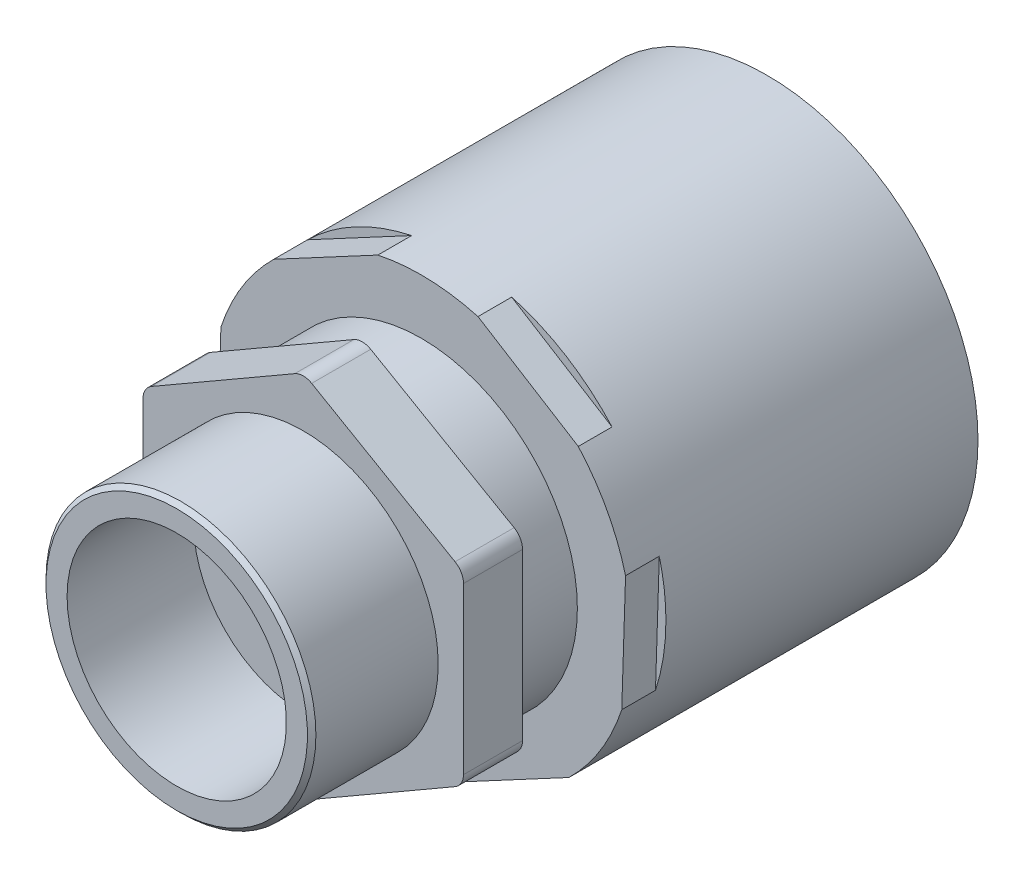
ISO-10303-21;
HEADER;
FILE_DESCRIPTION(('STEP AP214'),'2;1');
FILE_NAME('part.step','',(''),(''),'','','');
FILE_SCHEMA(('AUTOMOTIVE_DESIGN { 1 0 10303 214 1 1 1 1 }'));
ENDSEC;
DATA;
#1=APPLICATION_CONTEXT('core data for automotive mechanical design processes');
#2=APPLICATION_PROTOCOL_DEFINITION('international standard','automotive_design',2000,#1);
#3=PRODUCT_CONTEXT('',#1,'mechanical');
#4=PRODUCT('Part','Part','',(#3));
#5=PRODUCT_RELATED_PRODUCT_CATEGORY('part','',(#4));
#6=PRODUCT_DEFINITION_FORMATION('','',#4);
#7=PRODUCT_DEFINITION_CONTEXT('part definition',#1,'design');
#8=PRODUCT_DEFINITION('design','',#6,#7);
#9=PRODUCT_DEFINITION_SHAPE('','',#8);
#10=(LENGTH_UNIT() NAMED_UNIT(*) SI_UNIT(.MILLI.,.METRE.));
#11=(NAMED_UNIT(*) PLANE_ANGLE_UNIT() SI_UNIT($,.RADIAN.));
#12=(NAMED_UNIT(*) SI_UNIT($,.STERADIAN.) SOLID_ANGLE_UNIT());
#13=UNCERTAINTY_MEASURE_WITH_UNIT(LENGTH_MEASURE(1.E-05),#10,'distance_accuracy_value','');
#14=(GEOMETRIC_REPRESENTATION_CONTEXT(3) GLOBAL_UNCERTAINTY_ASSIGNED_CONTEXT((#13)) GLOBAL_UNIT_ASSIGNED_CONTEXT((#10,
#11,#12)) REPRESENTATION_CONTEXT('',''));
#15=CARTESIAN_POINT('',(0.,0.,0.));
#16=DIRECTION('',(0.,0.,1.));
#17=DIRECTION('',(1.,0.,0.));
#18=AXIS2_PLACEMENT_3D('',#15,#16,#17);
#19=CARTESIAN_POINT('',(0.,0.,15.));
#20=DIRECTION('',(0.,0.,1.));
#21=DIRECTION('',(1.,0.,0.));
#22=AXIS2_PLACEMENT_3D('',#19,#20,#21);
#23=PLANE('',#22);
#24=CARTESIAN_POINT('',(0.,0.,15.));
#25=DIRECTION('',(0.,0.,-1.));
#26=DIRECTION('',(-1.,0.,0.));
#27=AXIS2_PLACEMENT_3D('',#24,#25,#26);
#28=CIRCLE('',#27,13.);
#29=CARTESIAN_POINT('',(-13.,0.,15.));
#30=VERTEX_POINT('',#29);
#31=EDGE_CURVE('E20',#30,#30,#28,.F.);
#32=ORIENTED_EDGE('',*,*,#31,.T.);
#33=EDGE_LOOP('',(#32));
#34=FACE_BOUND('',#33,.T.);
#35=ADVANCED_FACE('F17',(#34),#23,.T.);
#36=CARTESIAN_POINT('',(0.,0.,30.));
#37=DIRECTION('',(0.,0.,-1.));
#38=DIRECTION('',(-1.,0.,0.));
#39=AXIS2_PLACEMENT_3D('',#36,#37,#38);
#40=CYLINDRICAL_SURFACE('',#39,13.);
#41=ORIENTED_EDGE('',*,*,#31,.F.);
#42=EDGE_LOOP('',(#41));
#43=FACE_BOUND('',#42,.T.);
#44=CARTESIAN_POINT('',(0.,0.,30.));
#45=DIRECTION('',(0.,0.,-1.));
#46=DIRECTION('',(-1.,0.,0.));
#47=AXIS2_PLACEMENT_3D('',#44,#45,#46);
#48=CIRCLE('',#47,13.);
#49=CARTESIAN_POINT('',(-13.,0.,30.));
#50=VERTEX_POINT('',#49);
#51=EDGE_CURVE('E409',#50,#50,#48,.T.);
#52=ORIENTED_EDGE('',*,*,#51,.F.);
#53=EDGE_LOOP('',(#52));
#54=FACE_BOUND('',#53,.T.);
#55=ADVANCED_FACE('F420',(#43,#54),#40,.F.);
#56=CARTESIAN_POINT('',(-15.5,-15.81,30.));
#57=DIRECTION('',(0.,0.,1.));
#58=DIRECTION('',(1.,0.,0.));
#59=AXIS2_PLACEMENT_3D('',#56,#57,#58);
#60=PLANE('',#59);
#61=ORIENTED_EDGE('',*,*,#51,.T.);
#62=EDGE_LOOP('',(#61));
#63=FACE_BOUND('',#62,.T.);
#64=CARTESIAN_POINT('',(0.,0.,30.));
#65=DIRECTION('',(0.,0.,-1.));
#66=DIRECTION('',(0.,1.,0.));
#67=AXIS2_PLACEMENT_3D('',#64,#65,#66);
#68=CIRCLE('',#67,15.5);
#69=CARTESIAN_POINT('',(0.,15.5,30.));
#70=VERTEX_POINT('',#69);
#71=EDGE_CURVE('E265',#70,#70,#68,.T.);
#72=ORIENTED_EDGE('',*,*,#71,.F.);
#73=EDGE_LOOP('',(#72));
#74=FACE_BOUND('',#73,.T.);
#75=ADVANCED_FACE('F423',(#63,#74),#60,.T.);
#76=CARTESIAN_POINT('',(0.,0.,29.500000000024));
#77=DIRECTION('',(0.,0.,-1.));
#78=DIRECTION('',(0.,1.,0.));
#79=AXIS2_PLACEMENT_3D('',#76,#77,#78);
#80=CONICAL_SURFACE('',#79,15.999999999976,0.785398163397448);
#81=CARTESIAN_POINT('',(0.,0.,29.500000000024));
#82=DIRECTION('',(0.,0.,1.));
#83=DIRECTION('',(1.,0.,0.));
#84=AXIS2_PLACEMENT_3D('',#81,#82,#83);
#85=CIRCLE('',#84,16.);
#86=CARTESIAN_POINT('',(16.,0.,29.500000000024));
#87=VERTEX_POINT('',#86);
#88=EDGE_CURVE('E261',#87,#87,#85,.F.);
#89=ORIENTED_EDGE('',*,*,#88,.F.);
#90=EDGE_LOOP('',(#89));
#91=FACE_BOUND('',#90,.T.);
#92=ORIENTED_EDGE('',*,*,#71,.T.);
#93=EDGE_LOOP('',(#92));
#94=FACE_BOUND('',#93,.T.);
#95=ADVANCED_FACE('F429',(#91,#94),#80,.T.);
#96=CARTESIAN_POINT('',(0.,0.,15.));
#97=DIRECTION('',(0.,0.,1.));
#98=DIRECTION('',(1.,0.,0.));
#99=AXIS2_PLACEMENT_3D('',#96,#97,#98);
#100=CYLINDRICAL_SURFACE('',#99,16.);
#101=ORIENTED_EDGE('',*,*,#88,.T.);
#102=EDGE_LOOP('',(#101));
#103=FACE_BOUND('',#102,.T.);
#104=CARTESIAN_POINT('',(0.,0.,15.));
#105=DIRECTION('',(0.,0.,1.));
#106=DIRECTION('',(1.,0.,0.));
#107=AXIS2_PLACEMENT_3D('',#104,#105,#106);
#108=CIRCLE('',#107,16.);
#109=CARTESIAN_POINT('',(16.,0.,15.));
#110=VERTEX_POINT('',#109);
#111=EDGE_CURVE('E264',#110,#110,#108,.T.);
#112=ORIENTED_EDGE('',*,*,#111,.T.);
#113=EDGE_LOOP('',(#112));
#114=FACE_BOUND('',#113,.T.);
#115=ADVANCED_FACE('F564',(#103,#114),#100,.T.);
#116=CARTESIAN_POINT('',(0.,0.,8.));
#117=DIRECTION('',(0.,0.,1.));
#118=DIRECTION('',(1.,0.,0.));
#119=AXIS2_PLACEMENT_3D('',#116,#117,#118);
#120=PLANE('',#119);
#121=CARTESIAN_POINT('',(0.,0.,8.));
#122=DIRECTION('',(0.,0.,-1.));
#123=DIRECTION('',(-1.,0.,0.));
#124=AXIS2_PLACEMENT_3D('',#121,#122,#123);
#125=CIRCLE('',#124,17.5);
#126=CARTESIAN_POINT('',(-17.5,0.,8.));
#127=VERTEX_POINT('',#126);
#128=EDGE_CURVE('E236',#127,#127,#125,.T.);
#129=ORIENTED_EDGE('',*,*,#128,.T.);
#130=EDGE_LOOP('',(#129));
#131=FACE_BOUND('',#130,.T.);
#132=ADVANCED_FACE('F561',(#131),#120,.F.);
#133=CARTESIAN_POINT('',(-23.000000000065,23.4600000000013,15.));
#134=DIRECTION('',(0.,0.,-1.));
#135=DIRECTION('',(-1.,0.,0.));
#136=AXIS2_PLACEMENT_3D('',#133,#134,#135);
#137=PLANE('',#136);
#138=CARTESIAN_POINT('',(17.,-9.81495457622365,15.));
#139=DIRECTION('',(0.,0.,1.));
#140=DIRECTION('',(1.,0.,0.));
#141=AXIS2_PLACEMENT_3D('',#138,#139,#140);
#142=CIRCLE('',#141,2.);
#143=CARTESIAN_POINT('',(19.,-9.81495457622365,15.));
#144=VERTEX_POINT('',#143);
#145=CARTESIAN_POINT('',(18.,-11.5470053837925,15.));
#146=VERTEX_POINT('',#145);
#147=EDGE_CURVE('E375',#144,#146,#142,.F.);
#148=ORIENTED_EDGE('',*,*,#147,.F.);
#149=DIRECTION('',(0.,1.,0.));
#150=VECTOR('',#149,1.);
#151=CARTESIAN_POINT('',(19.,-10.9696551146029,15.));
#152=LINE('',#151,#150);
#153=CARTESIAN_POINT('',(19.,9.81495457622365,15.));
#154=VERTEX_POINT('',#153);
#155=EDGE_CURVE('E232',#154,#144,#152,.F.);
#156=ORIENTED_EDGE('',*,*,#155,.F.);
#157=CARTESIAN_POINT('',(17.,9.81495457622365,15.));
#158=DIRECTION('',(0.,0.,1.));
#159=DIRECTION('',(1.,0.,0.));
#160=AXIS2_PLACEMENT_3D('',#157,#158,#159);
#161=CIRCLE('',#160,2.);
#162=CARTESIAN_POINT('',(18.,11.5470053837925,15.));
#163=VERTEX_POINT('',#162);
#164=EDGE_CURVE('E224',#163,#154,#161,.F.);
#165=ORIENTED_EDGE('',*,*,#164,.F.);
#166=DIRECTION('',(-0.866025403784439,0.5,0.));
#167=VECTOR('',#166,1.);
#168=CARTESIAN_POINT('',(19.,10.9696551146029,15.));
#169=LINE('',#168,#167);
#170=CARTESIAN_POINT('',(1.00000000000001,21.3619599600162,15.));
#171=VERTEX_POINT('',#170);
#172=EDGE_CURVE('E229',#171,#163,#169,.F.);
#173=ORIENTED_EDGE('',*,*,#172,.F.);
#174=CARTESIAN_POINT('',(0.,19.6299091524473,15.));
#175=DIRECTION('',(0.,0.,1.));
#176=DIRECTION('',(1.,0.,0.));
#177=AXIS2_PLACEMENT_3D('',#174,#175,#176);
#178=CIRCLE('',#177,2.);
#179=CARTESIAN_POINT('',(-0.99999999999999,21.3619599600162,15.));
#180=VERTEX_POINT('',#179);
#181=EDGE_CURVE('E246',#180,#171,#178,.F.);
#182=ORIENTED_EDGE('',*,*,#181,.F.);
#183=DIRECTION('',(-0.866025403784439,-0.5,0.));
#184=VECTOR('',#183,1.);
#185=CARTESIAN_POINT('',(0.,21.9393102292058,15.));
#186=LINE('',#185,#184);
#187=CARTESIAN_POINT('',(-18.,11.5470053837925,15.));
#188=VERTEX_POINT('',#187);
#189=EDGE_CURVE('E259',#188,#180,#186,.F.);
#190=ORIENTED_EDGE('',*,*,#189,.F.);
#191=CARTESIAN_POINT('',(-17.,9.81495457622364,15.));
#192=DIRECTION('',(0.,0.,1.));
#193=DIRECTION('',(1.,0.,0.));
#194=AXIS2_PLACEMENT_3D('',#191,#192,#193);
#195=CIRCLE('',#194,2.);
#196=CARTESIAN_POINT('',(-19.,9.81495457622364,15.));
#197=VERTEX_POINT('',#196);
#198=EDGE_CURVE('E393',#197,#188,#195,.F.);
#199=ORIENTED_EDGE('',*,*,#198,.F.);
#200=DIRECTION('',(0.,1.,0.));
#201=VECTOR('',#200,1.);
#202=CARTESIAN_POINT('',(-19.,10.9696551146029,15.));
#203=LINE('',#202,#201);
#204=CARTESIAN_POINT('',(-19.,-9.81495457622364,15.));
#205=VERTEX_POINT('',#204);
#206=EDGE_CURVE('E969',#205,#197,#203,.T.);
#207=ORIENTED_EDGE('',*,*,#206,.F.);
#208=CARTESIAN_POINT('',(-17.,-9.81495457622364,15.));
#209=DIRECTION('',(0.,0.,1.));
#210=DIRECTION('',(1.,0.,0.));
#211=AXIS2_PLACEMENT_3D('',#208,#209,#210);
#212=CIRCLE('',#211,2.);
#213=CARTESIAN_POINT('',(-18.,-11.5470053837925,15.));
#214=VERTEX_POINT('',#213);
#215=EDGE_CURVE('E387',#214,#205,#212,.F.);
#216=ORIENTED_EDGE('',*,*,#215,.F.);
#217=DIRECTION('',(0.866025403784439,-0.5,0.));
#218=VECTOR('',#217,1.);
#219=CARTESIAN_POINT('',(-19.,-10.9696551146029,15.));
#220=LINE('',#219,#218);
#221=CARTESIAN_POINT('',(-1.00000000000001,-21.3619599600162,15.));
#222=VERTEX_POINT('',#221);
#223=EDGE_CURVE('E982',#222,#214,#220,.F.);
#224=ORIENTED_EDGE('',*,*,#223,.F.);
#225=CARTESIAN_POINT('',(0.,-19.6299091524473,15.));
#226=DIRECTION('',(0.,0.,1.));
#227=DIRECTION('',(1.,0.,0.));
#228=AXIS2_PLACEMENT_3D('',#225,#226,#227);
#229=CIRCLE('',#228,2.);
#230=CARTESIAN_POINT('',(0.999999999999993,-21.3619599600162,15.));
#231=VERTEX_POINT('',#230);
#232=EDGE_CURVE('E381',#231,#222,#229,.F.);
#233=ORIENTED_EDGE('',*,*,#232,.F.);
#234=DIRECTION('',(0.866025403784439,0.5,0.));
#235=VECTOR('',#234,1.);
#236=CARTESIAN_POINT('',(0.,-21.9393102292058,15.));
#237=LINE('',#236,#235);
#238=EDGE_CURVE('E986',#146,#231,#237,.F.);
#239=ORIENTED_EDGE('',*,*,#238,.F.);
#240=EDGE_LOOP('',(#148,#156,#165,#173,#182,#190,#199,#207,#216,#224,#233,#239));
#241=FACE_BOUND('',#240,.T.);
#242=ORIENTED_EDGE('',*,*,#111,.F.);
#243=EDGE_LOOP('',(#242));
#244=FACE_BOUND('',#243,.T.);
#245=ADVANCED_FACE('F226',(#241,#244),#137,.F.);
#246=CARTESIAN_POINT('',(0.,0.,13.));
#247=DIRECTION('',(0.,0.,-1.));
#248=DIRECTION('',(-1.,0.,0.));
#249=AXIS2_PLACEMENT_3D('',#246,#247,#248);
#250=CYLINDRICAL_SURFACE('',#249,17.5);
#251=ORIENTED_EDGE('',*,*,#128,.F.);
#252=EDGE_LOOP('',(#251));
#253=FACE_BOUND('',#252,.T.);
#254=CARTESIAN_POINT('',(0.,0.,-3.000000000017));
#255=DIRECTION('',(0.,0.,-1.));
#256=DIRECTION('',(-1.,0.,0.));
#257=AXIS2_PLACEMENT_3D('',#254,#255,#256);
#258=CIRCLE('',#257,17.5);
#259=CARTESIAN_POINT('',(-17.5,0.,-3.000000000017));
#260=VERTEX_POINT('',#259);
#261=EDGE_CURVE('E370',#260,#260,#258,.F.);
#262=ORIENTED_EDGE('',*,*,#261,.F.);
#263=EDGE_LOOP('',(#262));
#264=FACE_BOUND('',#263,.T.);
#265=ADVANCED_FACE('F555',(#253,#264),#250,.F.);
#266=CARTESIAN_POINT('',(17.,9.81495457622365,8.));
#267=DIRECTION('',(0.,0.,1.));
#268=DIRECTION('',(1.,0.,0.));
#269=AXIS2_PLACEMENT_3D('',#266,#267,#268);
#270=CYLINDRICAL_SURFACE('',#269,2.);
#271=ORIENTED_EDGE('',*,*,#164,.T.);
#272=DIRECTION('',(0.,0.,1.));
#273=VECTOR('',#272,1.);
#274=CARTESIAN_POINT('',(19.,9.81495457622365,8.));
#275=LINE('',#274,#273);
#276=CARTESIAN_POINT('',(19.,9.81495457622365,8.));
#277=VERTEX_POINT('',#276);
#278=EDGE_CURVE('E374',#277,#154,#275,.T.);
#279=ORIENTED_EDGE('',*,*,#278,.F.);
#280=CARTESIAN_POINT('',(17.,9.81495457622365,8.));
#281=DIRECTION('',(0.,0.,1.));
#282=DIRECTION('',(1.,0.,0.));
#283=AXIS2_PLACEMENT_3D('',#280,#281,#282);
#284=CIRCLE('',#283,2.);
#285=CARTESIAN_POINT('',(18.,11.5470053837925,8.));
#286=VERTEX_POINT('',#285);
#287=EDGE_CURVE('E242',#277,#286,#284,.T.);
#288=ORIENTED_EDGE('',*,*,#287,.T.);
#289=DIRECTION('',(0.,0.,1.));
#290=VECTOR('',#289,1.);
#291=CARTESIAN_POINT('',(18.,11.5470053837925,8.));
#292=LINE('',#291,#290);
#293=EDGE_CURVE('E239',#163,#286,#292,.F.);
#294=ORIENTED_EDGE('',*,*,#293,.F.);
#295=EDGE_LOOP('',(#271,#279,#288,#294));
#296=FACE_BOUND('',#295,.T.);
#297=ADVANCED_FACE('F240',(#296),#270,.T.);
#298=CARTESIAN_POINT('',(19.,10.9696551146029,8.));
#299=DIRECTION('',(0.5,0.866025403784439,0.));
#300=DIRECTION('',(-0.866025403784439,0.5,0.));
#301=AXIS2_PLACEMENT_3D('',#298,#299,#300);
#302=PLANE('',#301);
#303=ORIENTED_EDGE('',*,*,#172,.T.);
#304=ORIENTED_EDGE('',*,*,#293,.T.);
#305=DIRECTION('',(-0.866025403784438,0.5,0.));
#306=VECTOR('',#305,1.);
#307=CARTESIAN_POINT('',(18.,11.5470053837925,8.));
#308=LINE('',#307,#306);
#309=CARTESIAN_POINT('',(1.00000000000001,21.3619599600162,8.));
#310=VERTEX_POINT('',#309);
#311=EDGE_CURVE('E367',#286,#310,#308,.T.);
#312=ORIENTED_EDGE('',*,*,#311,.T.);
#313=DIRECTION('',(0.,0.,1.));
#314=VECTOR('',#313,1.);
#315=CARTESIAN_POINT('',(1.00000000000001,21.3619599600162,8.));
#316=LINE('',#315,#314);
#317=EDGE_CURVE('E250',#171,#310,#316,.F.);
#318=ORIENTED_EDGE('',*,*,#317,.F.);
#319=EDGE_LOOP('',(#303,#304,#312,#318));
#320=FACE_BOUND('',#319,.T.);
#321=ADVANCED_FACE('F248',(#320),#302,.T.);
#322=CARTESIAN_POINT('',(0.,19.6299091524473,8.));
#323=DIRECTION('',(0.,0.,1.));
#324=DIRECTION('',(1.,0.,0.));
#325=AXIS2_PLACEMENT_3D('',#322,#323,#324);
#326=CYLINDRICAL_SURFACE('',#325,2.);
#327=ORIENTED_EDGE('',*,*,#181,.T.);
#328=ORIENTED_EDGE('',*,*,#317,.T.);
#329=CARTESIAN_POINT('',(0.,19.6299091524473,8.));
#330=DIRECTION('',(0.,0.,1.));
#331=DIRECTION('',(1.,0.,0.));
#332=AXIS2_PLACEMENT_3D('',#329,#330,#331);
#333=CIRCLE('',#332,2.);
#334=CARTESIAN_POINT('',(-0.99999999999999,21.3619599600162,8.));
#335=VERTEX_POINT('',#334);
#336=EDGE_CURVE('E364',#310,#335,#333,.T.);
#337=ORIENTED_EDGE('',*,*,#336,.T.);
#338=DIRECTION('',(0.,0.,1.));
#339=VECTOR('',#338,1.);
#340=CARTESIAN_POINT('',(-0.99999999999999,21.3619599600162,8.));
#341=LINE('',#340,#339);
#342=EDGE_CURVE('E398',#180,#335,#341,.F.);
#343=ORIENTED_EDGE('',*,*,#342,.F.);
#344=EDGE_LOOP('',(#327,#328,#337,#343));
#345=FACE_BOUND('',#344,.T.);
#346=ADVANCED_FACE('F546',(#345),#326,.T.);
#347=CARTESIAN_POINT('',(0.,21.9393102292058,8.));
#348=DIRECTION('',(-0.5,0.866025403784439,0.));
#349=DIRECTION('',(-0.866025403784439,-0.5,0.));
#350=AXIS2_PLACEMENT_3D('',#347,#348,#349);
#351=PLANE('',#350);
#352=ORIENTED_EDGE('',*,*,#189,.T.);
#353=ORIENTED_EDGE('',*,*,#342,.T.);
#354=DIRECTION('',(-0.866025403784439,-0.5,0.));
#355=VECTOR('',#354,1.);
#356=CARTESIAN_POINT('',(-0.999999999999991,21.3619599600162,8.));
#357=LINE('',#356,#355);
#358=CARTESIAN_POINT('',(-18.,11.5470053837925,8.));
#359=VERTEX_POINT('',#358);
#360=EDGE_CURVE('E363',#335,#359,#357,.T.);
#361=ORIENTED_EDGE('',*,*,#360,.T.);
#362=DIRECTION('',(0.,0.,1.));
#363=VECTOR('',#362,1.);
#364=CARTESIAN_POINT('',(-18.,11.5470053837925,8.));
#365=LINE('',#364,#363);
#366=EDGE_CURVE('E397',#188,#359,#365,.F.);
#367=ORIENTED_EDGE('',*,*,#366,.F.);
#368=EDGE_LOOP('',(#352,#353,#361,#367));
#369=FACE_BOUND('',#368,.T.);
#370=ADVANCED_FACE('F542',(#369),#351,.T.);
#371=CARTESIAN_POINT('',(-17.,9.81495457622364,8.));
#372=DIRECTION('',(0.,0.,1.));
#373=DIRECTION('',(1.,0.,0.));
#374=AXIS2_PLACEMENT_3D('',#371,#372,#373);
#375=CYLINDRICAL_SURFACE('',#374,2.);
#376=ORIENTED_EDGE('',*,*,#198,.T.);
#377=ORIENTED_EDGE('',*,*,#366,.T.);
#378=CARTESIAN_POINT('',(-17.,9.81495457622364,8.));
#379=DIRECTION('',(0.,0.,1.));
#380=DIRECTION('',(1.,0.,0.));
#381=AXIS2_PLACEMENT_3D('',#378,#379,#380);
#382=CIRCLE('',#381,2.);
#383=CARTESIAN_POINT('',(-19.,9.81495457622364,8.));
#384=VERTEX_POINT('',#383);
#385=EDGE_CURVE('E360',#359,#384,#382,.T.);
#386=ORIENTED_EDGE('',*,*,#385,.T.);
#387=DIRECTION('',(0.,0.,1.));
#388=VECTOR('',#387,1.);
#389=CARTESIAN_POINT('',(-19.,9.81495457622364,8.));
#390=LINE('',#389,#388);
#391=EDGE_CURVE('E392',#197,#384,#390,.F.);
#392=ORIENTED_EDGE('',*,*,#391,.F.);
#393=EDGE_LOOP('',(#376,#377,#386,#392));
#394=FACE_BOUND('',#393,.T.);
#395=ADVANCED_FACE('F538',(#394),#375,.T.);
#396=CARTESIAN_POINT('',(-19.,10.9696551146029,8.));
#397=DIRECTION('',(-1.,0.,0.));
#398=DIRECTION('',(0.,0.,1.));
#399=AXIS2_PLACEMENT_3D('',#396,#397,#398);
#400=PLANE('',#399);
#401=ORIENTED_EDGE('',*,*,#206,.T.);
#402=ORIENTED_EDGE('',*,*,#391,.T.);
#403=DIRECTION('',(0.,1.,0.));
#404=VECTOR('',#403,1.);
#405=CARTESIAN_POINT('',(-19.,0.,8.));
#406=LINE('',#405,#404);
#407=CARTESIAN_POINT('',(-19.,-9.81495457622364,8.));
#408=VERTEX_POINT('',#407);
#409=EDGE_CURVE('E359',#384,#408,#406,.F.);
#410=ORIENTED_EDGE('',*,*,#409,.T.);
#411=DIRECTION('',(0.,0.,1.));
#412=VECTOR('',#411,1.);
#413=CARTESIAN_POINT('',(-19.,-9.81495457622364,8.));
#414=LINE('',#413,#412);
#415=EDGE_CURVE('E391',#205,#408,#414,.F.);
#416=ORIENTED_EDGE('',*,*,#415,.F.);
#417=EDGE_LOOP('',(#401,#402,#410,#416));
#418=FACE_BOUND('',#417,.T.);
#419=ADVANCED_FACE('F534',(#418),#400,.T.);
#420=CARTESIAN_POINT('',(-17.,-9.81495457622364,8.));
#421=DIRECTION('',(0.,0.,1.));
#422=DIRECTION('',(1.,0.,0.));
#423=AXIS2_PLACEMENT_3D('',#420,#421,#422);
#424=CYLINDRICAL_SURFACE('',#423,2.);
#425=ORIENTED_EDGE('',*,*,#215,.T.);
#426=ORIENTED_EDGE('',*,*,#415,.T.);
#427=CARTESIAN_POINT('',(-17.,-9.81495457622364,8.));
#428=DIRECTION('',(0.,0.,1.));
#429=DIRECTION('',(1.,0.,0.));
#430=AXIS2_PLACEMENT_3D('',#427,#428,#429);
#431=CIRCLE('',#430,2.);
#432=CARTESIAN_POINT('',(-18.,-11.5470053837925,8.));
#433=VERTEX_POINT('',#432);
#434=EDGE_CURVE('E356',#408,#433,#431,.T.);
#435=ORIENTED_EDGE('',*,*,#434,.T.);
#436=DIRECTION('',(0.,0.,1.));
#437=VECTOR('',#436,1.);
#438=CARTESIAN_POINT('',(-18.,-11.5470053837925,8.));
#439=LINE('',#438,#437);
#440=EDGE_CURVE('E386',#214,#433,#439,.F.);
#441=ORIENTED_EDGE('',*,*,#440,.F.);
#442=EDGE_LOOP('',(#425,#426,#435,#441));
#443=FACE_BOUND('',#442,.T.);
#444=ADVANCED_FACE('F530',(#443),#424,.T.);
#445=CARTESIAN_POINT('',(-19.,-10.9696551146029,8.));
#446=DIRECTION('',(-0.5,-0.866025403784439,0.));
#447=DIRECTION('',(0.866025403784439,-0.5,0.));
#448=AXIS2_PLACEMENT_3D('',#445,#446,#447);
#449=PLANE('',#448);
#450=ORIENTED_EDGE('',*,*,#223,.T.);
#451=ORIENTED_EDGE('',*,*,#440,.T.);
#452=DIRECTION('',(0.866025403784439,-0.5,0.));
#453=VECTOR('',#452,1.);
#454=CARTESIAN_POINT('',(-18.,-11.5470053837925,8.));
#455=LINE('',#454,#453);
#456=CARTESIAN_POINT('',(-1.00000000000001,-21.3619599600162,8.));
#457=VERTEX_POINT('',#456);
#458=EDGE_CURVE('E355',#433,#457,#455,.T.);
#459=ORIENTED_EDGE('',*,*,#458,.T.);
#460=DIRECTION('',(0.,0.,1.));
#461=VECTOR('',#460,1.);
#462=CARTESIAN_POINT('',(-1.00000000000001,-21.3619599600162,8.));
#463=LINE('',#462,#461);
#464=EDGE_CURVE('E385',#222,#457,#463,.F.);
#465=ORIENTED_EDGE('',*,*,#464,.F.);
#466=EDGE_LOOP('',(#450,#451,#459,#465));
#467=FACE_BOUND('',#466,.T.);
#468=ADVANCED_FACE('F526',(#467),#449,.T.);
#469=CARTESIAN_POINT('',(0.,-19.6299091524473,8.));
#470=DIRECTION('',(0.,0.,1.));
#471=DIRECTION('',(1.,0.,0.));
#472=AXIS2_PLACEMENT_3D('',#469,#470,#471);
#473=CYLINDRICAL_SURFACE('',#472,2.);
#474=ORIENTED_EDGE('',*,*,#232,.T.);
#475=ORIENTED_EDGE('',*,*,#464,.T.);
#476=CARTESIAN_POINT('',(0.,-19.6299091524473,8.));
#477=DIRECTION('',(0.,0.,1.));
#478=DIRECTION('',(1.,0.,0.));
#479=AXIS2_PLACEMENT_3D('',#476,#477,#478);
#480=CIRCLE('',#479,2.);
#481=CARTESIAN_POINT('',(0.999999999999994,-21.3619599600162,8.));
#482=VERTEX_POINT('',#481);
#483=EDGE_CURVE('E352',#457,#482,#480,.T.);
#484=ORIENTED_EDGE('',*,*,#483,.T.);
#485=DIRECTION('',(0.,0.,1.));
#486=VECTOR('',#485,1.);
#487=CARTESIAN_POINT('',(0.999999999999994,-21.3619599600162,8.));
#488=LINE('',#487,#486);
#489=EDGE_CURVE('E380',#231,#482,#488,.F.);
#490=ORIENTED_EDGE('',*,*,#489,.F.);
#491=EDGE_LOOP('',(#474,#475,#484,#490));
#492=FACE_BOUND('',#491,.T.);
#493=ADVANCED_FACE('F522',(#492),#473,.T.);
#494=CARTESIAN_POINT('',(0.,-21.9393102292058,8.));
#495=DIRECTION('',(0.5,-0.866025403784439,0.));
#496=DIRECTION('',(0.866025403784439,0.5,0.));
#497=AXIS2_PLACEMENT_3D('',#494,#495,#496);
#498=PLANE('',#497);
#499=ORIENTED_EDGE('',*,*,#238,.T.);
#500=ORIENTED_EDGE('',*,*,#489,.T.);
#501=DIRECTION('',(0.866025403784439,0.5,0.));
#502=VECTOR('',#501,1.);
#503=CARTESIAN_POINT('',(0.999999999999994,-21.3619599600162,8.));
#504=LINE('',#503,#502);
#505=CARTESIAN_POINT('',(18.,-11.5470053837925,8.));
#506=VERTEX_POINT('',#505);
#507=EDGE_CURVE('E351',#482,#506,#504,.T.);
#508=ORIENTED_EDGE('',*,*,#507,.T.);
#509=DIRECTION('',(0.,0.,1.));
#510=VECTOR('',#509,1.);
#511=CARTESIAN_POINT('',(18.,-11.5470053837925,8.));
#512=LINE('',#511,#510);
#513=EDGE_CURVE('E379',#146,#506,#512,.F.);
#514=ORIENTED_EDGE('',*,*,#513,.F.);
#515=EDGE_LOOP('',(#499,#500,#508,#514));
#516=FACE_BOUND('',#515,.T.);
#517=ADVANCED_FACE('F518',(#516),#498,.T.);
#518=CARTESIAN_POINT('',(17.,-9.81495457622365,8.));
#519=DIRECTION('',(0.,0.,1.));
#520=DIRECTION('',(1.,0.,0.));
#521=AXIS2_PLACEMENT_3D('',#518,#519,#520);
#522=CYLINDRICAL_SURFACE('',#521,2.);
#523=ORIENTED_EDGE('',*,*,#147,.T.);
#524=ORIENTED_EDGE('',*,*,#513,.T.);
#525=CARTESIAN_POINT('',(17.,-9.81495457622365,8.));
#526=DIRECTION('',(0.,0.,1.));
#527=DIRECTION('',(1.,0.,0.));
#528=AXIS2_PLACEMENT_3D('',#525,#526,#527);
#529=CIRCLE('',#528,2.);
#530=CARTESIAN_POINT('',(19.,-9.81495457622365,8.));
#531=VERTEX_POINT('',#530);
#532=EDGE_CURVE('E348',#506,#531,#529,.T.);
#533=ORIENTED_EDGE('',*,*,#532,.T.);
#534=DIRECTION('',(0.,0.,1.));
#535=VECTOR('',#534,1.);
#536=CARTESIAN_POINT('',(19.,-9.81495457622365,8.));
#537=LINE('',#536,#535);
#538=EDGE_CURVE('E991',#144,#531,#537,.F.);
#539=ORIENTED_EDGE('',*,*,#538,.F.);
#540=EDGE_LOOP('',(#523,#524,#533,#539));
#541=FACE_BOUND('',#540,.T.);
#542=ADVANCED_FACE('F514',(#541),#522,.T.);
#543=CARTESIAN_POINT('',(19.,-10.9696551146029,8.));
#544=DIRECTION('',(1.,0.,0.));
#545=DIRECTION('',(0.,1.,0.));
#546=AXIS2_PLACEMENT_3D('',#543,#544,#545);
#547=PLANE('',#546);
#548=DIRECTION('',(0.,1.,0.));
#549=VECTOR('',#548,1.);
#550=CARTESIAN_POINT('',(19.,0.,8.));
#551=LINE('',#550,#549);
#552=EDGE_CURVE('E347',#531,#277,#551,.T.);
#553=ORIENTED_EDGE('',*,*,#552,.T.);
#554=ORIENTED_EDGE('',*,*,#278,.T.);
#555=ORIENTED_EDGE('',*,*,#155,.T.);
#556=ORIENTED_EDGE('',*,*,#538,.T.);
#557=EDGE_LOOP('',(#553,#554,#555,#556));
#558=FACE_BOUND('',#557,.T.);
#559=ADVANCED_FACE('F510',(#558),#547,.T.);
#560=CARTESIAN_POINT('',(-41.5,35.9400542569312,-3.000000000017));
#561=DIRECTION('',(0.,0.,-1.));
#562=DIRECTION('',(-1.,0.,0.));
#563=AXIS2_PLACEMENT_3D('',#560,#561,#562);
#564=PLANE('',#563);
#565=ORIENTED_EDGE('',*,*,#261,.T.);
#566=EDGE_LOOP('',(#565));
#567=FACE_BOUND('',#566,.T.);
#568=CARTESIAN_POINT('',(0.,0.,-3.000000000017));
#569=DIRECTION('',(0.,0.,1.));
#570=DIRECTION('',(1.,0.,0.));
#571=AXIS2_PLACEMENT_3D('',#568,#569,#570);
#572=CIRCLE('',#571,19.);
#573=CARTESIAN_POINT('',(19.,0.,-3.000000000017));
#574=VERTEX_POINT('',#573);
#575=EDGE_CURVE('E343',#574,#574,#572,.F.);
#576=ORIENTED_EDGE('',*,*,#575,.T.);
#577=EDGE_LOOP('',(#576));
#578=FACE_BOUND('',#577,.T.);
#579=ADVANCED_FACE('F506',(#567,#578),#564,.T.);
#580=CARTESIAN_POINT('',(0.,0.,8.));
#581=DIRECTION('',(0.,0.,1.));
#582=DIRECTION('',(1.,0.,0.));
#583=AXIS2_PLACEMENT_3D('',#580,#581,#582);
#584=PLANE('',#583);
#585=CARTESIAN_POINT('',(0.,0.,7.99999999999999));
#586=DIRECTION('',(0.,0.,1.));
#587=DIRECTION('',(1.,0.,0.));
#588=AXIS2_PLACEMENT_3D('',#585,#586,#587);
#589=CIRCLE('',#588,18.5);
#590=CARTESIAN_POINT('',(18.5,0.,7.99999999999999));
#591=VERTEX_POINT('',#590);
#592=EDGE_CURVE('E338',#591,#591,#589,.F.);
#593=ORIENTED_EDGE('',*,*,#592,.F.);
#594=EDGE_LOOP('',(#593));
#595=FACE_BOUND('',#594,.T.);
#596=ORIENTED_EDGE('',*,*,#532,.F.);
#597=ORIENTED_EDGE('',*,*,#507,.F.);
#598=ORIENTED_EDGE('',*,*,#483,.F.);
#599=ORIENTED_EDGE('',*,*,#458,.F.);
#600=ORIENTED_EDGE('',*,*,#434,.F.);
#601=ORIENTED_EDGE('',*,*,#409,.F.);
#602=ORIENTED_EDGE('',*,*,#385,.F.);
#603=ORIENTED_EDGE('',*,*,#360,.F.);
#604=ORIENTED_EDGE('',*,*,#336,.F.);
#605=ORIENTED_EDGE('',*,*,#311,.F.);
#606=ORIENTED_EDGE('',*,*,#287,.F.);
#607=ORIENTED_EDGE('',*,*,#552,.F.);
#608=EDGE_LOOP('',(#596,#597,#598,#599,#600,#601,#602,#603,#604,#605,#606,#607));
#609=FACE_BOUND('',#608,.T.);
#610=ADVANCED_FACE('F502',(#595,#609),#584,.F.);
#611=CARTESIAN_POINT('',(0.,0.,-40.000000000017));
#612=DIRECTION('',(0.,0.,1.));
#613=DIRECTION('',(1.,0.,0.));
#614=AXIS2_PLACEMENT_3D('',#611,#612,#613);
#615=CYLINDRICAL_SURFACE('',#614,19.);
#616=CARTESIAN_POINT('',(0.,0.,-40.000000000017));
#617=DIRECTION('',(0.,0.,1.));
#618=DIRECTION('',(1.,0.,0.));
#619=AXIS2_PLACEMENT_3D('',#616,#617,#618);
#620=CIRCLE('',#619,19.);
#621=CARTESIAN_POINT('',(19.,0.,-40.000000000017));
#622=VERTEX_POINT('',#621);
#623=EDGE_CURVE('E332',#622,#622,#620,.T.);
#624=ORIENTED_EDGE('',*,*,#623,.F.);
#625=EDGE_LOOP('',(#624));
#626=FACE_BOUND('',#625,.T.);
#627=ORIENTED_EDGE('',*,*,#575,.F.);
#628=EDGE_LOOP('',(#627));
#629=FACE_BOUND('',#628,.T.);
#630=ADVANCED_FACE('F498',(#626,#629),#615,.F.);
#631=CARTESIAN_POINT('',(0.,0.,-58.396969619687));
#632=DIRECTION('',(0.,0.,1.));
#633=DIRECTION('',(1.,0.,0.));
#634=AXIS2_PLACEMENT_3D('',#631,#632,#633);
#635=CYLINDRICAL_SURFACE('',#634,18.5);
#636=ORIENTED_EDGE('',*,*,#592,.T.);
#637=EDGE_LOOP('',(#636));
#638=FACE_BOUND('',#637,.T.);
#639=CARTESIAN_POINT('',(0.,0.,0.999999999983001));
#640=DIRECTION('',(0.,0.,1.));
#641=DIRECTION('',(1.,0.,0.));
#642=AXIS2_PLACEMENT_3D('',#639,#640,#641);
#643=CIRCLE('',#642,18.5);
#644=CARTESIAN_POINT('',(18.5,0.,0.999999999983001));
#645=VERTEX_POINT('',#644);
#646=EDGE_CURVE('E326',#645,#645,#643,.T.);
#647=ORIENTED_EDGE('',*,*,#646,.T.);
#648=EDGE_LOOP('',(#647));
#649=FACE_BOUND('',#648,.T.);
#650=ADVANCED_FACE('F494',(#638,#649),#635,.T.);
#651=CARTESIAN_POINT('',(0.,0.,-3.000000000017));
#652=DIRECTION('',(0.,0.,1.));
#653=DIRECTION('',(1.,0.,0.));
#654=AXIS2_PLACEMENT_3D('',#651,#652,#653);
#655=PLANE('',#654);
#656=CARTESIAN_POINT('',(0.,0.,-3.000000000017));
#657=DIRECTION('',(0.,0.,1.));
#658=DIRECTION('',(1.,0.,0.));
#659=AXIS2_PLACEMENT_3D('',#656,#657,#658);
#660=CIRCLE('',#659,25.);
#661=CARTESIAN_POINT('',(17.4967564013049,-17.8567498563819,-3.000000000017));
#662=VERTEX_POINT('',#661);
#663=CARTESIAN_POINT('',(5.15347627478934,-24.4630677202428,-3.000000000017));
#664=VERTEX_POINT('',#663);
#665=EDGE_CURVE('E316',#662,#664,#660,.F.);
#666=ORIENTED_EDGE('',*,*,#665,.F.);
#667=DIRECTION('',(0.881662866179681,0.47187984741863,0.));
#668=VECTOR('',#667,1.);
#669=CARTESIAN_POINT('',(5.15347627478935,-24.4630677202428,-3.000000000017));
#670=LINE('',#669,#668);
#671=EDGE_CURVE('E342',#664,#662,#670,.T.);
#672=ORIENTED_EDGE('',*,*,#671,.F.);
#673=EDGE_LOOP('',(#666,#672));
#674=FACE_BOUND('',#673,.T.);
#675=ADVANCED_FACE('F490',(#674),#655,.T.);
#676=CARTESIAN_POINT('',(5.15347627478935,-24.4630677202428,-3.000000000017));
#677=DIRECTION('',(0.47187984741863,-0.881662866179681,0.));
#678=DIRECTION('',(0.881662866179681,0.47187984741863,0.));
#679=AXIS2_PLACEMENT_3D('',#676,#677,#678);
#680=PLANE('',#679);
#681=ORIENTED_EDGE('',*,*,#671,.T.);
#682=DIRECTION('',(0.,0.,1.));
#683=VECTOR('',#682,1.);
#684=CARTESIAN_POINT('',(17.4967564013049,-17.8567498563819,-40.000000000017));
#685=LINE('',#684,#683);
#686=CARTESIAN_POINT('',(17.4967564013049,-17.8567498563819,0.999999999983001));
#687=VERTEX_POINT('',#686);
#688=EDGE_CURVE('E320',#687,#662,#685,.F.);
#689=ORIENTED_EDGE('',*,*,#688,.F.);
#690=DIRECTION('',(-0.881662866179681,-0.471879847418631,0.));
#691=VECTOR('',#690,1.);
#692=CARTESIAN_POINT('',(17.4967564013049,-17.8567498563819,0.999999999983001));
#693=LINE('',#692,#691);
#694=CARTESIAN_POINT('',(5.15347627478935,-24.4630677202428,0.999999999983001));
#695=VERTEX_POINT('',#694);
#696=EDGE_CURVE('E330',#687,#695,#693,.T.);
#697=ORIENTED_EDGE('',*,*,#696,.T.);
#698=DIRECTION('',(0.,0.,1.));
#699=VECTOR('',#698,1.);
#700=CARTESIAN_POINT('',(5.15347627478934,-24.4630677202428,-40.000000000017));
#701=LINE('',#700,#699);
#702=EDGE_CURVE('E315',#664,#695,#701,.T.);
#703=ORIENTED_EDGE('',*,*,#702,.F.);
#704=EDGE_LOOP('',(#681,#689,#697,#703));
#705=FACE_BOUND('',#704,.T.);
#706=ADVANCED_FACE('F486',(#705),#680,.T.);
#707=CARTESIAN_POINT('',(0.,0.,-3.000000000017));
#708=DIRECTION('',(0.,0.,1.));
#709=DIRECTION('',(1.,0.,0.));
#710=AXIS2_PLACEMENT_3D('',#707,#708,#709);
#711=PLANE('',#710);
#712=CARTESIAN_POINT('',(0.,0.,-3.000000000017));
#713=DIRECTION('',(0.,0.,1.));
#714=DIRECTION('',(1.,0.,0.));
#715=AXIS2_PLACEMENT_3D('',#712,#713,#714);
#716=CIRCLE('',#715,25.);
#717=CARTESIAN_POINT('',(-6.71602080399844,-24.081010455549,-3.000000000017));
#718=VERTEX_POINT('',#717);
#719=CARTESIAN_POINT('',(-18.6088999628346,-16.6945752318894,-3.000000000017));
#720=VERTEX_POINT('',#719);
#721=EDGE_CURVE('E306',#718,#720,#716,.F.);
#722=ORIENTED_EDGE('',*,*,#721,.F.);
#723=DIRECTION('',(0.849491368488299,-0.527602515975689,0.));
#724=VECTOR('',#723,1.);
#725=CARTESIAN_POINT('',(-18.6088999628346,-16.6945752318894,-3.000000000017));
#726=LINE('',#725,#724);
#727=EDGE_CURVE('E337',#720,#718,#726,.T.);
#728=ORIENTED_EDGE('',*,*,#727,.F.);
#729=EDGE_LOOP('',(#722,#728));
#730=FACE_BOUND('',#729,.T.);
#731=ADVANCED_FACE('F482',(#730),#711,.T.);
#732=CARTESIAN_POINT('',(-18.6088999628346,-16.6945752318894,-3.000000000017));
#733=DIRECTION('',(-0.527602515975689,-0.849491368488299,0.));
#734=DIRECTION('',(0.849491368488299,-0.527602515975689,0.));
#735=AXIS2_PLACEMENT_3D('',#732,#733,#734);
#736=PLANE('',#735);
#737=ORIENTED_EDGE('',*,*,#727,.T.);
#738=DIRECTION('',(0.,0.,1.));
#739=VECTOR('',#738,1.);
#740=CARTESIAN_POINT('',(-6.71602080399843,-24.081010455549,-40.000000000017));
#741=LINE('',#740,#739);
#742=CARTESIAN_POINT('',(-6.71602080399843,-24.081010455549,0.999999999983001));
#743=VERTEX_POINT('',#742);
#744=EDGE_CURVE('E310',#743,#718,#741,.F.);
#745=ORIENTED_EDGE('',*,*,#744,.F.);
#746=DIRECTION('',(-0.849491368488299,0.527602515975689,0.));
#747=VECTOR('',#746,1.);
#748=CARTESIAN_POINT('',(-6.71602080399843,-24.081010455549,0.999999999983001));
#749=LINE('',#748,#747);
#750=CARTESIAN_POINT('',(-18.6088999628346,-16.6945752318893,0.999999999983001));
#751=VERTEX_POINT('',#750);
#752=EDGE_CURVE('E1072',#743,#751,#749,.T.);
#753=ORIENTED_EDGE('',*,*,#752,.T.);
#754=DIRECTION('',(0.,0.,1.));
#755=VECTOR('',#754,1.);
#756=CARTESIAN_POINT('',(-18.6088999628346,-16.6945752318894,-40.000000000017));
#757=LINE('',#756,#755);
#758=EDGE_CURVE('E305',#720,#751,#757,.T.);
#759=ORIENTED_EDGE('',*,*,#758,.F.);
#760=EDGE_LOOP('',(#737,#745,#753,#759));
#761=FACE_BOUND('',#760,.T.);
#762=ADVANCED_FACE('F478',(#761),#736,.T.);
#763=CARTESIAN_POINT('',(0.,0.,-40.000000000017));
#764=DIRECTION('',(0.,0.,-1.));
#765=DIRECTION('',(-1.,0.,0.));
#766=AXIS2_PLACEMENT_3D('',#763,#764,#765);
#767=PLANE('',#766);
#768=ORIENTED_EDGE('',*,*,#623,.T.);
#769=EDGE_LOOP('',(#768));
#770=FACE_BOUND('',#769,.T.);
#771=CARTESIAN_POINT('',(0.,0.,-40.000000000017));
#772=DIRECTION('',(0.,0.,1.));
#773=DIRECTION('',(1.,0.,0.));
#774=AXIS2_PLACEMENT_3D('',#771,#772,#773);
#775=CIRCLE('',#774,25.);
#776=CARTESIAN_POINT('',(25.,0.,-40.000000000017));
#777=VERTEX_POINT('',#776);
#778=EDGE_CURVE('E296',#777,#777,#775,.T.);
#779=ORIENTED_EDGE('',*,*,#778,.F.);
#780=EDGE_LOOP('',(#779));
#781=FACE_BOUND('',#780,.T.);
#782=ADVANCED_FACE('F474',(#770,#781),#767,.T.);
#783=CARTESIAN_POINT('',(0.,0.,-3.000000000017));
#784=DIRECTION('',(0.,0.,1.));
#785=DIRECTION('',(1.,0.,0.));
#786=AXIS2_PLACEMENT_3D('',#783,#784,#785);
#787=PLANE('',#786);
#788=CARTESIAN_POINT('',(0.,0.,-3.000000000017));
#789=DIRECTION('',(0.,0.,1.));
#790=DIRECTION('',(1.,0.,0.));
#791=AXIS2_PLACEMENT_3D('',#788,#789,#790);
#792=CIRCLE('',#791,25.);
#793=CARTESIAN_POINT('',(-24.2127772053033,-6.22426059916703,-3.000000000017));
#794=VERTEX_POINT('',#793);
#795=CARTESIAN_POINT('',(-23.762376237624,7.76849248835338,-3.000000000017));
#796=VERTEX_POINT('',#795);
#797=EDGE_CURVE('E292',#794,#796,#792,.F.);
#798=ORIENTED_EDGE('',*,*,#797,.F.);
#799=DIRECTION('',(-0.0321714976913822,-0.999482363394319,0.));
#800=VECTOR('',#799,1.);
#801=CARTESIAN_POINT('',(-23.762376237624,7.7684924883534,-3.000000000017));
#802=LINE('',#801,#800);
#803=EDGE_CURVE('E336',#796,#794,#802,.T.);
#804=ORIENTED_EDGE('',*,*,#803,.F.);
#805=EDGE_LOOP('',(#798,#804));
#806=FACE_BOUND('',#805,.T.);
#807=ADVANCED_FACE('F470',(#806),#787,.T.);
#808=CARTESIAN_POINT('',(-23.762376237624,7.7684924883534,-3.000000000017));
#809=DIRECTION('',(-0.999482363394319,0.0321714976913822,0.));
#810=DIRECTION('',(-0.0321714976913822,-0.999482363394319,0.));
#811=AXIS2_PLACEMENT_3D('',#808,#809,#810);
#812=PLANE('',#811);
#813=ORIENTED_EDGE('',*,*,#803,.T.);
#814=DIRECTION('',(0.,0.,1.));
#815=VECTOR('',#814,1.);
#816=CARTESIAN_POINT('',(-24.2127772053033,-6.22426059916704,-40.000000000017));
#817=LINE('',#816,#815);
#818=CARTESIAN_POINT('',(-24.2127772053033,-6.22426059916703,0.999999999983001));
#819=VERTEX_POINT('',#818);
#820=EDGE_CURVE('E300',#819,#794,#817,.F.);
#821=ORIENTED_EDGE('',*,*,#820,.F.);
#822=DIRECTION('',(0.0321714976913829,0.999482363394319,0.));
#823=VECTOR('',#822,1.);
#824=CARTESIAN_POINT('',(-24.2127772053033,-6.22426059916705,0.999999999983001));
#825=LINE('',#824,#823);
#826=CARTESIAN_POINT('',(-23.762376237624,7.7684924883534,0.999999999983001));
#827=VERTEX_POINT('',#826);
#828=EDGE_CURVE('E1075',#819,#827,#825,.T.);
#829=ORIENTED_EDGE('',*,*,#828,.T.);
#830=DIRECTION('',(0.,0.,1.));
#831=VECTOR('',#830,1.);
#832=CARTESIAN_POINT('',(-23.762376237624,7.7684924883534,-40.000000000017));
#833=LINE('',#832,#831);
#834=EDGE_CURVE('E291',#796,#827,#833,.T.);
#835=ORIENTED_EDGE('',*,*,#834,.F.);
#836=EDGE_LOOP('',(#813,#821,#829,#835));
#837=FACE_BOUND('',#836,.T.);
#838=ADVANCED_FACE('F466',(#837),#812,.T.);
#839=CARTESIAN_POINT('',(0.,0.,-3.000000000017));
#840=DIRECTION('',(0.,0.,1.));
#841=DIRECTION('',(1.,0.,0.));
#842=AXIS2_PLACEMENT_3D('',#839,#840,#841);
#843=PLANE('',#842);
#844=CARTESIAN_POINT('',(0.,0.,-3.000000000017));
#845=DIRECTION('',(0.,0.,1.));
#846=DIRECTION('',(1.,0.,0.));
#847=AXIS2_PLACEMENT_3D('',#844,#845,#846);
#848=CIRCLE('',#847,25.);
#849=CARTESIAN_POINT('',(-17.4967564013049,17.856749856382,-3.000000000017));
#850=VERTEX_POINT('',#849);
#851=CARTESIAN_POINT('',(-5.1534762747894,24.4630677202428,-3.000000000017));
#852=VERTEX_POINT('',#851);
#853=EDGE_CURVE('E282',#850,#852,#848,.F.);
#854=ORIENTED_EDGE('',*,*,#853,.F.);
#855=DIRECTION('',(-0.881662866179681,-0.47187984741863,0.));
#856=VECTOR('',#855,1.);
#857=CARTESIAN_POINT('',(-5.15347627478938,24.4630677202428,-3.000000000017));
#858=LINE('',#857,#856);
#859=EDGE_CURVE('E1051',#852,#850,#858,.T.);
#860=ORIENTED_EDGE('',*,*,#859,.F.);
#861=EDGE_LOOP('',(#854,#860));
#862=FACE_BOUND('',#861,.T.);
#863=ADVANCED_FACE('F462',(#862),#843,.T.);
#864=CARTESIAN_POINT('',(-5.15347627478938,24.4630677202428,-3.000000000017));
#865=DIRECTION('',(-0.47187984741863,0.881662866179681,0.));
#866=DIRECTION('',(-0.881662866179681,-0.47187984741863,0.));
#867=AXIS2_PLACEMENT_3D('',#864,#865,#866);
#868=PLANE('',#867);
#869=ORIENTED_EDGE('',*,*,#859,.T.);
#870=DIRECTION('',(0.,0.,1.));
#871=VECTOR('',#870,1.);
#872=CARTESIAN_POINT('',(-17.4967564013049,17.856749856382,-40.000000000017));
#873=LINE('',#872,#871);
#874=CARTESIAN_POINT('',(-17.4967564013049,17.856749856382,0.999999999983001));
#875=VERTEX_POINT('',#874);
#876=EDGE_CURVE('E286',#875,#850,#873,.F.);
#877=ORIENTED_EDGE('',*,*,#876,.F.);
#878=DIRECTION('',(0.881662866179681,0.471879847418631,0.));
#879=VECTOR('',#878,1.);
#880=CARTESIAN_POINT('',(-17.4967564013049,17.856749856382,0.999999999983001));
#881=LINE('',#880,#879);
#882=CARTESIAN_POINT('',(-5.1534762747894,24.4630677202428,0.999999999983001));
#883=VERTEX_POINT('',#882);
#884=EDGE_CURVE('E1077',#875,#883,#881,.T.);
#885=ORIENTED_EDGE('',*,*,#884,.T.);
#886=DIRECTION('',(0.,0.,1.));
#887=VECTOR('',#886,1.);
#888=CARTESIAN_POINT('',(-5.15347627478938,24.4630677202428,-40.000000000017));
#889=LINE('',#888,#887);
#890=EDGE_CURVE('E281',#852,#883,#889,.T.);
#891=ORIENTED_EDGE('',*,*,#890,.F.);
#892=EDGE_LOOP('',(#869,#877,#885,#891));
#893=FACE_BOUND('',#892,.T.);
#894=ADVANCED_FACE('F458',(#893),#868,.T.);
#895=CARTESIAN_POINT('',(0.,0.,-3.000000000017));
#896=DIRECTION('',(0.,0.,1.));
#897=DIRECTION('',(1.,0.,0.));
#898=AXIS2_PLACEMENT_3D('',#895,#896,#897);
#899=PLANE('',#898);
#900=CARTESIAN_POINT('',(0.,0.,-3.000000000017));
#901=DIRECTION('',(0.,0.,1.));
#902=DIRECTION('',(1.,0.,0.));
#903=AXIS2_PLACEMENT_3D('',#900,#901,#902);
#904=CIRCLE('',#903,25.);
#905=CARTESIAN_POINT('',(6.71602080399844,24.081010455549,-3.000000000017));
#906=VERTEX_POINT('',#905);
#907=CARTESIAN_POINT('',(18.6088999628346,16.6945752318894,-3.000000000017));
#908=VERTEX_POINT('',#907);
#909=EDGE_CURVE('E272',#906,#908,#904,.F.);
#910=ORIENTED_EDGE('',*,*,#909,.F.);
#911=DIRECTION('',(-0.849491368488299,0.527602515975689,0.));
#912=VECTOR('',#911,1.);
#913=CARTESIAN_POINT('',(18.6088999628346,16.6945752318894,-3.000000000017));
#914=LINE('',#913,#912);
#915=EDGE_CURVE('E331',#908,#906,#914,.T.);
#916=ORIENTED_EDGE('',*,*,#915,.F.);
#917=EDGE_LOOP('',(#910,#916));
#918=FACE_BOUND('',#917,.T.);
#919=ADVANCED_FACE('F454',(#918),#899,.T.);
#920=CARTESIAN_POINT('',(18.6088999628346,16.6945752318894,-3.000000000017));
#921=DIRECTION('',(0.527602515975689,0.849491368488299,0.));
#922=DIRECTION('',(-0.849491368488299,0.527602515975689,0.));
#923=AXIS2_PLACEMENT_3D('',#920,#921,#922);
#924=PLANE('',#923);
#925=ORIENTED_EDGE('',*,*,#915,.T.);
#926=DIRECTION('',(0.,0.,1.));
#927=VECTOR('',#926,1.);
#928=CARTESIAN_POINT('',(6.71602080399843,24.081010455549,-40.000000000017));
#929=LINE('',#928,#927);
#930=CARTESIAN_POINT('',(6.71602080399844,24.081010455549,0.999999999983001));
#931=VERTEX_POINT('',#930);
#932=EDGE_CURVE('E276',#931,#906,#929,.F.);
#933=ORIENTED_EDGE('',*,*,#932,.F.);
#934=DIRECTION('',(0.849491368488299,-0.527602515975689,0.));
#935=VECTOR('',#934,1.);
#936=CARTESIAN_POINT('',(6.71602080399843,24.081010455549,0.999999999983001));
#937=LINE('',#936,#935);
#938=CARTESIAN_POINT('',(18.6088999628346,16.6945752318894,0.999999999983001));
#939=VERTEX_POINT('',#938);
#940=EDGE_CURVE('E1080',#931,#939,#937,.T.);
#941=ORIENTED_EDGE('',*,*,#940,.T.);
#942=DIRECTION('',(0.,0.,1.));
#943=VECTOR('',#942,1.);
#944=CARTESIAN_POINT('',(18.6088999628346,16.6945752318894,-40.000000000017));
#945=LINE('',#944,#943);
#946=EDGE_CURVE('E271',#908,#939,#945,.T.);
#947=ORIENTED_EDGE('',*,*,#946,.F.);
#948=EDGE_LOOP('',(#925,#933,#941,#947));
#949=FACE_BOUND('',#948,.T.);
#950=ADVANCED_FACE('F450',(#949),#924,.T.);
#951=CARTESIAN_POINT('',(0.,0.,0.999999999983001));
#952=DIRECTION('',(0.,0.,-1.));
#953=DIRECTION('',(-1.,0.,0.));
#954=AXIS2_PLACEMENT_3D('',#951,#952,#953);
#955=PLANE('',#954);
#956=CARTESIAN_POINT('',(0.,0.,0.999999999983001));
#957=DIRECTION('',(0.,0.,1.));
#958=DIRECTION('',(1.,0.,0.));
#959=AXIS2_PLACEMENT_3D('',#956,#957,#958);
#960=CIRCLE('',#959,25.);
#961=CARTESIAN_POINT('',(24.2127772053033,6.22426059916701,0.999999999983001));
#962=VERTEX_POINT('',#961);
#963=EDGE_CURVE('E267',#939,#962,#960,.F.);
#964=ORIENTED_EDGE('',*,*,#963,.F.);
#965=ORIENTED_EDGE('',*,*,#940,.F.);
#966=CARTESIAN_POINT('',(0.,0.,0.999999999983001));
#967=DIRECTION('',(0.,0.,1.));
#968=DIRECTION('',(1.,0.,0.));
#969=AXIS2_PLACEMENT_3D('',#966,#967,#968);
#970=CIRCLE('',#969,25.);
#971=EDGE_CURVE('E277',#883,#931,#970,.F.);
#972=ORIENTED_EDGE('',*,*,#971,.F.);
#973=ORIENTED_EDGE('',*,*,#884,.F.);
#974=CARTESIAN_POINT('',(0.,0.,0.999999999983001));
#975=DIRECTION('',(0.,0.,1.));
#976=DIRECTION('',(1.,0.,0.));
#977=AXIS2_PLACEMENT_3D('',#974,#975,#976);
#978=CIRCLE('',#977,25.);
#979=EDGE_CURVE('E287',#827,#875,#978,.F.);
#980=ORIENTED_EDGE('',*,*,#979,.F.);
#981=ORIENTED_EDGE('',*,*,#828,.F.);
#982=CARTESIAN_POINT('',(0.,0.,0.999999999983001));
#983=DIRECTION('',(0.,0.,1.));
#984=DIRECTION('',(1.,0.,0.));
#985=AXIS2_PLACEMENT_3D('',#982,#983,#984);
#986=CIRCLE('',#985,25.);
#987=EDGE_CURVE('E301',#751,#819,#986,.F.);
#988=ORIENTED_EDGE('',*,*,#987,.F.);
#989=ORIENTED_EDGE('',*,*,#752,.F.);
#990=CARTESIAN_POINT('',(0.,0.,0.999999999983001));
#991=DIRECTION('',(0.,0.,1.));
#992=DIRECTION('',(1.,0.,0.));
#993=AXIS2_PLACEMENT_3D('',#990,#991,#992);
#994=CIRCLE('',#993,25.);
#995=EDGE_CURVE('E311',#695,#743,#994,.F.);
#996=ORIENTED_EDGE('',*,*,#995,.F.);
#997=ORIENTED_EDGE('',*,*,#696,.F.);
#998=CARTESIAN_POINT('',(0.,0.,0.999999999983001));
#999=DIRECTION('',(0.,0.,1.));
#1000=DIRECTION('',(1.,0.,0.));
#1001=AXIS2_PLACEMENT_3D('',#998,#999,#1000);
#1002=CIRCLE('',#1001,25.);
#1003=CARTESIAN_POINT('',(23.762376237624,-7.76849248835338,0.999999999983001));
#1004=VERTEX_POINT('',#1003);
#1005=EDGE_CURVE('E321',#1004,#687,#1002,.F.);
#1006=ORIENTED_EDGE('',*,*,#1005,.F.);
#1007=DIRECTION('',(0.0321714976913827,0.999482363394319,0.));
#1008=VECTOR('',#1007,1.);
#1009=CARTESIAN_POINT('',(23.762376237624,-7.76849248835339,0.999999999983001));
#1010=LINE('',#1009,#1008);
#1011=EDGE_CURVE('E1082',#962,#1004,#1010,.F.);
#1012=ORIENTED_EDGE('',*,*,#1011,.F.);
#1013=EDGE_LOOP('',(#964,#965,#972,#973,#980,#981,#988,#989,#996,#997,#1006,#1012));
#1014=FACE_BOUND('',#1013,.T.);
#1015=ORIENTED_EDGE('',*,*,#646,.F.);
#1016=EDGE_LOOP('',(#1015));
#1017=FACE_BOUND('',#1016,.T.);
#1018=ADVANCED_FACE('F447',(#1014,#1017),#955,.F.);
#1019=CARTESIAN_POINT('',(23.762376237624,-7.76849248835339,-3.000000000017));
#1020=DIRECTION('',(0.999482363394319,-0.0321714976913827,0.));
#1021=DIRECTION('',(0.0321714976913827,0.999482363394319,0.));
#1022=AXIS2_PLACEMENT_3D('',#1019,#1020,#1021);
#1023=PLANE('',#1022);
#1024=DIRECTION('',(-0.0321714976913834,-0.999482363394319,0.));
#1025=VECTOR('',#1024,1.);
#1026=CARTESIAN_POINT('',(24.2127772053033,6.22426059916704,-3.000000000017));
#1027=LINE('',#1026,#1025);
#1028=CARTESIAN_POINT('',(24.2127772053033,6.22426059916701,-3.000000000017));
#1029=VERTEX_POINT('',#1028);
#1030=CARTESIAN_POINT('',(23.762376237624,-7.7684924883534,-3.000000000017));
#1031=VERTEX_POINT('',#1030);
#1032=EDGE_CURVE('E40',#1029,#1031,#1027,.T.);
#1033=ORIENTED_EDGE('',*,*,#1032,.F.);
#1034=DIRECTION('',(0.,0.,1.));
#1035=VECTOR('',#1034,1.);
#1036=CARTESIAN_POINT('',(24.2127772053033,6.22426059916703,-40.000000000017));
#1037=LINE('',#1036,#1035);
#1038=EDGE_CURVE('E27',#962,#1029,#1037,.F.);
#1039=ORIENTED_EDGE('',*,*,#1038,.F.);
#1040=ORIENTED_EDGE('',*,*,#1011,.T.);
#1041=DIRECTION('',(0.,0.,1.));
#1042=VECTOR('',#1041,1.);
#1043=CARTESIAN_POINT('',(23.762376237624,-7.76849248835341,-40.000000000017));
#1044=LINE('',#1043,#1042);
#1045=EDGE_CURVE('E325',#1031,#1004,#1044,.T.);
#1046=ORIENTED_EDGE('',*,*,#1045,.F.);
#1047=EDGE_LOOP('',(#1033,#1039,#1040,#1046));
#1048=FACE_BOUND('',#1047,.T.);
#1049=ADVANCED_FACE('F439',(#1048),#1023,.T.);
#1050=CARTESIAN_POINT('',(0.,0.,-3.000000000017));
#1051=DIRECTION('',(0.,0.,1.));
#1052=DIRECTION('',(1.,0.,0.));
#1053=AXIS2_PLACEMENT_3D('',#1050,#1051,#1052);
#1054=PLANE('',#1053);
#1055=CARTESIAN_POINT('',(0.,0.,-3.000000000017));
#1056=DIRECTION('',(0.,0.,1.));
#1057=DIRECTION('',(1.,0.,0.));
#1058=AXIS2_PLACEMENT_3D('',#1055,#1056,#1057);
#1059=CIRCLE('',#1058,25.);
#1060=EDGE_CURVE('E11',#1029,#1031,#1059,.F.);
#1061=ORIENTED_EDGE('',*,*,#1060,.F.);
#1062=ORIENTED_EDGE('',*,*,#1032,.T.);
#1063=EDGE_LOOP('',(#1061,#1062));
#1064=FACE_BOUND('',#1063,.T.);
#1065=ADVANCED_FACE('F433',(#1064),#1054,.T.);
#1066=CARTESIAN_POINT('',(0.,0.,-40.000000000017));
#1067=DIRECTION('',(0.,0.,1.));
#1068=DIRECTION('',(1.,0.,0.));
#1069=AXIS2_PLACEMENT_3D('',#1066,#1067,#1068);
#1070=CYLINDRICAL_SURFACE('',#1069,25.);
#1071=ORIENTED_EDGE('',*,*,#820,.T.);
#1072=ORIENTED_EDGE('',*,*,#797,.T.);
#1073=ORIENTED_EDGE('',*,*,#834,.T.);
#1074=ORIENTED_EDGE('',*,*,#979,.T.);
#1075=ORIENTED_EDGE('',*,*,#876,.T.);
#1076=ORIENTED_EDGE('',*,*,#853,.T.);
#1077=ORIENTED_EDGE('',*,*,#890,.T.);
#1078=ORIENTED_EDGE('',*,*,#971,.T.);
#1079=ORIENTED_EDGE('',*,*,#932,.T.);
#1080=ORIENTED_EDGE('',*,*,#909,.T.);
#1081=ORIENTED_EDGE('',*,*,#946,.T.);
#1082=ORIENTED_EDGE('',*,*,#963,.T.);
#1083=ORIENTED_EDGE('',*,*,#1038,.T.);
#1084=ORIENTED_EDGE('',*,*,#1060,.T.);
#1085=ORIENTED_EDGE('',*,*,#1045,.T.);
#1086=ORIENTED_EDGE('',*,*,#1005,.T.);
#1087=ORIENTED_EDGE('',*,*,#688,.T.);
#1088=ORIENTED_EDGE('',*,*,#665,.T.);
#1089=ORIENTED_EDGE('',*,*,#702,.T.);
#1090=ORIENTED_EDGE('',*,*,#995,.T.);
#1091=ORIENTED_EDGE('',*,*,#744,.T.);
#1092=ORIENTED_EDGE('',*,*,#721,.T.);
#1093=ORIENTED_EDGE('',*,*,#758,.T.);
#1094=ORIENTED_EDGE('',*,*,#987,.T.);
#1095=EDGE_LOOP('',(#1071,#1072,#1073,#1074,#1075,#1076,#1077,#1078,#1079,#1080,#1081,#1082,
#1083,#1084,#1085,#1086,#1087,#1088,#1089,#1090,#1091,#1092,#1093,#1094));
#1096=FACE_BOUND('',#1095,.T.);
#1097=ORIENTED_EDGE('',*,*,#778,.T.);
#1098=EDGE_LOOP('',(#1097));
#1099=FACE_BOUND('',#1098,.T.);
#1100=ADVANCED_FACE('F431',(#1096,#1099),#1070,.T.);
#1101=CLOSED_SHELL('',(#35,#55,#75,#95,#115,#132,#245,#265,#297,#321,#346,#370,#395,#419,#444,
#468,#493,#517,#542,#559,#579,#610,#630,#650,#675,#706,#731,#762,#782,#807,#838,#863,#894,#919,
#950,#1018,#1049,#1065,#1100));
#1102=MANIFOLD_SOLID_BREP('B1',#1101);
#1103=ADVANCED_BREP_SHAPE_REPRESENTATION('',(#18,#1102),#14);
#1104=SHAPE_DEFINITION_REPRESENTATION(#9,#1103);
ENDSEC;
END-ISO-10303-21;
